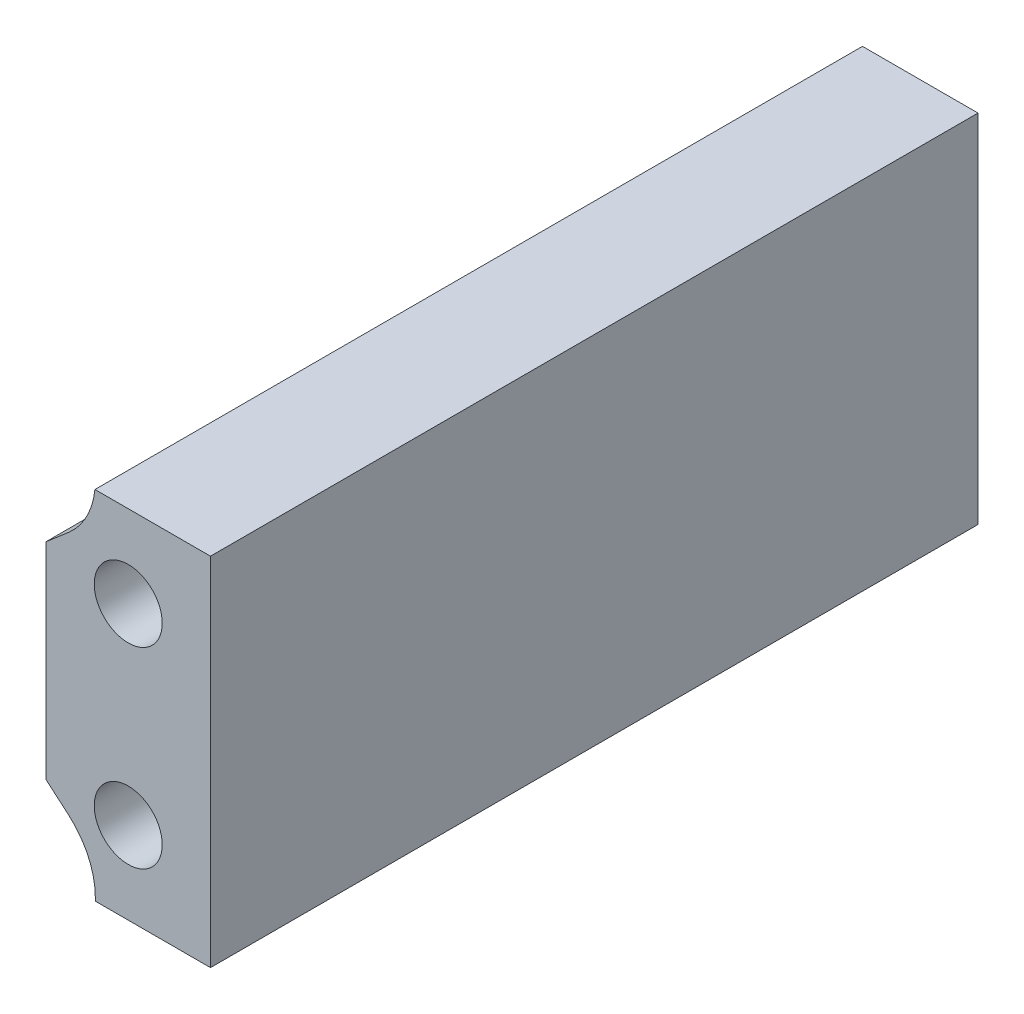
ISO-10303-21;
HEADER;
FILE_DESCRIPTION(('STEP AP214'),'2;1');
FILE_NAME('part.step','',(''),(''),'','','');
FILE_SCHEMA(('AUTOMOTIVE_DESIGN { 1 0 10303 214 1 1 1 1 }'));
ENDSEC;
DATA;
#1=APPLICATION_CONTEXT('core data for automotive mechanical design processes');
#2=APPLICATION_PROTOCOL_DEFINITION('international standard','automotive_design',2000,#1);
#3=PRODUCT_CONTEXT('',#1,'mechanical');
#4=PRODUCT('Part','Part','',(#3));
#5=PRODUCT_RELATED_PRODUCT_CATEGORY('part','',(#4));
#6=PRODUCT_DEFINITION_FORMATION('','',#4);
#7=PRODUCT_DEFINITION_CONTEXT('part definition',#1,'design');
#8=PRODUCT_DEFINITION('design','',#6,#7);
#9=PRODUCT_DEFINITION_SHAPE('','',#8);
#10=(LENGTH_UNIT() NAMED_UNIT(*) SI_UNIT(.MILLI.,.METRE.));
#11=(NAMED_UNIT(*) PLANE_ANGLE_UNIT() SI_UNIT($,.RADIAN.));
#12=(NAMED_UNIT(*) SI_UNIT($,.STERADIAN.) SOLID_ANGLE_UNIT());
#13=UNCERTAINTY_MEASURE_WITH_UNIT(LENGTH_MEASURE(1.E-05),#10,'distance_accuracy_value','');
#14=(GEOMETRIC_REPRESENTATION_CONTEXT(3) GLOBAL_UNCERTAINTY_ASSIGNED_CONTEXT((#13)) GLOBAL_UNIT_ASSIGNED_CONTEXT((#10,
#11,#12)) REPRESENTATION_CONTEXT('',''));
#15=CARTESIAN_POINT('',(0.,0.,0.));
#16=DIRECTION('',(0.,0.,1.));
#17=DIRECTION('',(1.,0.,0.));
#18=AXIS2_PLACEMENT_3D('',#15,#16,#17);
#19=CARTESIAN_POINT('',(-5.44446038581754,20.4047482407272,70.));
#20=DIRECTION('',(0.650791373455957,-0.759256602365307,0.));
#21=DIRECTION('',(0.,0.,-1.));
#22=AXIS2_PLACEMENT_3D('',#19,#20,#21);
#23=PLANE('',#22);
#24=DIRECTION('',(-0.759256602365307,-0.650791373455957,0.));
#25=VECTOR('',#24,1.);
#26=CARTESIAN_POINT('',(-5.44446038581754,20.4047482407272,70.));
#27=LINE('',#26,#25);
#28=CARTESIAN_POINT('',(-5.44446038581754,20.4047482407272,70.));
#29=VERTEX_POINT('',#28);
#30=CARTESIAN_POINT('',(-7.5,18.6428571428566,70.));
#31=VERTEX_POINT('',#30);
#32=EDGE_CURVE('E160',#29,#31,#27,.T.);
#33=ORIENTED_EDGE('',*,*,#32,.F.);
#34=DIRECTION('',(0.,0.,-1.));
#35=VECTOR('',#34,1.);
#36=CARTESIAN_POINT('',(-5.44446038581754,20.4047482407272,70.));
#37=LINE('',#36,#35);
#38=CARTESIAN_POINT('',(-5.44446038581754,20.4047482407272,0.));
#39=VERTEX_POINT('',#38);
#40=EDGE_CURVE('E11',#29,#39,#37,.T.);
#41=ORIENTED_EDGE('',*,*,#40,.T.);
#42=DIRECTION('',(-0.759256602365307,-0.650791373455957,0.));
#43=VECTOR('',#42,1.);
#44=CARTESIAN_POINT('',(-5.44446038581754,20.4047482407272,0.));
#45=LINE('',#44,#43);
#46=CARTESIAN_POINT('',(-7.5,18.6428571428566,0.));
#47=VERTEX_POINT('',#46);
#48=EDGE_CURVE('E180',#39,#47,#45,.T.);
#49=ORIENTED_EDGE('',*,*,#48,.T.);
#50=DIRECTION('',(0.,0.,-1.));
#51=VECTOR('',#50,1.);
#52=CARTESIAN_POINT('',(-7.5,18.6428571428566,70.));
#53=LINE('',#52,#51);
#54=EDGE_CURVE('E203',#31,#47,#53,.T.);
#55=ORIENTED_EDGE('',*,*,#54,.F.);
#56=EDGE_LOOP('',(#33,#41,#49,#55));
#57=FACE_BOUND('',#56,.T.);
#58=ADVANCED_FACE('F17',(#57),#23,.F.);
#59=CARTESIAN_POINT('',(-10.0000000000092,25.7195444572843,70.));
#60=DIRECTION('',(0.,0.,-1.));
#61=DIRECTION('',(-1.,0.,0.));
#62=AXIS2_PLACEMENT_3D('',#59,#60,#61);
#63=CYLINDRICAL_SURFACE('',#62,7.);
#64=CARTESIAN_POINT('',(-10.0000000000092,25.7195444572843,0.));
#65=DIRECTION('',(0.,0.,-1.));
#66=DIRECTION('',(-1.,0.,0.));
#67=AXIS2_PLACEMENT_3D('',#64,#65,#66);
#68=CIRCLE('',#67,7.);
#69=CARTESIAN_POINT('',(-3.03707993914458,25.,0.));
#70=VERTEX_POINT('',#69);
#71=EDGE_CURVE('E184',#70,#39,#68,.T.);
#72=ORIENTED_EDGE('',*,*,#71,.T.);
#73=ORIENTED_EDGE('',*,*,#40,.F.);
#74=CARTESIAN_POINT('',(-10.0000000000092,25.7195444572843,70.));
#75=DIRECTION('',(0.,0.,-1.));
#76=DIRECTION('',(-1.,0.,0.));
#77=AXIS2_PLACEMENT_3D('',#74,#75,#76);
#78=CIRCLE('',#77,7.);
#79=CARTESIAN_POINT('',(-3.03707993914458,25.,70.));
#80=VERTEX_POINT('',#79);
#81=EDGE_CURVE('E166',#80,#29,#78,.T.);
#82=ORIENTED_EDGE('',*,*,#81,.F.);
#83=DIRECTION('',(0.,0.,1.));
#84=VECTOR('',#83,1.);
#85=CARTESIAN_POINT('',(-3.03707993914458,25.,70.));
#86=LINE('',#85,#84);
#87=EDGE_CURVE('E195',#70,#80,#86,.T.);
#88=ORIENTED_EDGE('',*,*,#87,.F.);
#89=EDGE_LOOP('',(#72,#73,#82,#88));
#90=FACE_BOUND('',#89,.T.);
#91=ADVANCED_FACE('F19',(#90),#63,.F.);
#92=CARTESIAN_POINT('',(-10.0000000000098,-7.21954445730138,70.));
#93=DIRECTION('',(0.,0.,-1.));
#94=DIRECTION('',(-1.,0.,0.));
#95=AXIS2_PLACEMENT_3D('',#92,#93,#94);
#96=CYLINDRICAL_SURFACE('',#95,7.);
#97=CARTESIAN_POINT('',(-10.0000000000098,-7.21954445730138,0.));
#98=DIRECTION('',(0.,0.,-1.));
#99=DIRECTION('',(-1.,0.,0.));
#100=AXIS2_PLACEMENT_3D('',#97,#98,#99);
#101=CIRCLE('',#100,7.);
#102=CARTESIAN_POINT('',(-5.4444603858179,-1.90474824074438,0.));
#103=VERTEX_POINT('',#102);
#104=CARTESIAN_POINT('',(-3.00000000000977,-7.2195444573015,0.));
#105=VERTEX_POINT('',#104);
#106=EDGE_CURVE('E171',#103,#105,#101,.T.);
#107=ORIENTED_EDGE('',*,*,#106,.T.);
#108=DIRECTION('',(0.,0.,-1.));
#109=VECTOR('',#108,1.);
#110=CARTESIAN_POINT('',(-3.00000000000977,-7.2195444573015,70.));
#111=LINE('',#110,#109);
#112=CARTESIAN_POINT('',(-3.00000000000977,-7.2195444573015,70.));
#113=VERTEX_POINT('',#112);
#114=EDGE_CURVE('E127',#113,#105,#111,.T.);
#115=ORIENTED_EDGE('',*,*,#114,.F.);
#116=CARTESIAN_POINT('',(-10.0000000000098,-7.21954445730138,70.));
#117=DIRECTION('',(0.,0.,-1.));
#118=DIRECTION('',(-1.,0.,0.));
#119=AXIS2_PLACEMENT_3D('',#116,#117,#118);
#120=CIRCLE('',#119,7.);
#121=CARTESIAN_POINT('',(-5.4444603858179,-1.90474824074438,70.));
#122=VERTEX_POINT('',#121);
#123=EDGE_CURVE('E132',#122,#113,#120,.T.);
#124=ORIENTED_EDGE('',*,*,#123,.F.);
#125=DIRECTION('',(0.,0.,-1.));
#126=VECTOR('',#125,1.);
#127=CARTESIAN_POINT('',(-5.4444603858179,-1.90474824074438,70.));
#128=LINE('',#127,#126);
#129=EDGE_CURVE('E26',#122,#103,#128,.T.);
#130=ORIENTED_EDGE('',*,*,#129,.T.);
#131=EDGE_LOOP('',(#107,#115,#124,#130));
#132=FACE_BOUND('',#131,.T.);
#133=ADVANCED_FACE('F139',(#132),#96,.F.);
#134=CARTESIAN_POINT('',(-7.55553961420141,-0.0952517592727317,70.));
#135=DIRECTION('',(0.650791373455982,0.759256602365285,0.));
#136=DIRECTION('',(0.,0.,-1.));
#137=AXIS2_PLACEMENT_3D('',#134,#135,#136);
#138=PLANE('',#137);
#139=DIRECTION('',(0.759256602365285,-0.650791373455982,0.));
#140=VECTOR('',#139,1.);
#141=CARTESIAN_POINT('',(-7.55553961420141,-0.0952517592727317,0.));
#142=LINE('',#141,#140);
#143=CARTESIAN_POINT('',(-7.5,-0.142857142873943,0.));
#144=VERTEX_POINT('',#143);
#145=EDGE_CURVE('E121',#144,#103,#142,.T.);
#146=ORIENTED_EDGE('',*,*,#145,.T.);
#147=ORIENTED_EDGE('',*,*,#129,.F.);
#148=DIRECTION('',(0.759256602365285,-0.650791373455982,0.));
#149=VECTOR('',#148,1.);
#150=CARTESIAN_POINT('',(-7.55553961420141,-0.0952517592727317,70.));
#151=LINE('',#150,#149);
#152=CARTESIAN_POINT('',(-7.5,-0.142857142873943,70.));
#153=VERTEX_POINT('',#152);
#154=EDGE_CURVE('E118',#153,#122,#151,.T.);
#155=ORIENTED_EDGE('',*,*,#154,.F.);
#156=DIRECTION('',(0.,0.,1.));
#157=VECTOR('',#156,1.);
#158=CARTESIAN_POINT('',(-7.5,-0.142857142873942,70.));
#159=LINE('',#158,#157);
#160=EDGE_CURVE('E200',#144,#153,#159,.T.);
#161=ORIENTED_EDGE('',*,*,#160,.F.);
#162=EDGE_LOOP('',(#146,#147,#155,#161));
#163=FACE_BOUND('',#162,.T.);
#164=ADVANCED_FACE('F117',(#163),#138,.F.);
#165=CARTESIAN_POINT('',(-3.00000000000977,-7.2195444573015,70.));
#166=DIRECTION('',(1.,0.,0.));
#167=DIRECTION('',(0.,-1.,0.));
#168=AXIS2_PLACEMENT_3D('',#165,#166,#167);
#169=PLANE('',#168);
#170=DIRECTION('',(0.,-1.,0.));
#171=VECTOR('',#170,1.);
#172=CARTESIAN_POINT('',(-3.00000000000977,-7.2195444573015,70.));
#173=LINE('',#172,#171);
#174=CARTESIAN_POINT('',(-3.00000000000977,-7.5,70.));
#175=VERTEX_POINT('',#174);
#176=EDGE_CURVE('E142',#113,#175,#173,.T.);
#177=ORIENTED_EDGE('',*,*,#176,.F.);
#178=ORIENTED_EDGE('',*,*,#114,.T.);
#179=DIRECTION('',(0.,-1.,0.));
#180=VECTOR('',#179,1.);
#181=CARTESIAN_POINT('',(-3.00000000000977,-7.2195444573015,0.));
#182=LINE('',#181,#180);
#183=CARTESIAN_POINT('',(-3.00000000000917,-7.5,0.));
#184=VERTEX_POINT('',#183);
#185=EDGE_CURVE('E137',#105,#184,#182,.T.);
#186=ORIENTED_EDGE('',*,*,#185,.T.);
#187=DIRECTION('',(0.,0.,-1.));
#188=VECTOR('',#187,1.);
#189=CARTESIAN_POINT('',(-3.00000000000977,-7.5,70.));
#190=LINE('',#189,#188);
#191=EDGE_CURVE('E206',#175,#184,#190,.T.);
#192=ORIENTED_EDGE('',*,*,#191,.F.);
#193=EDGE_LOOP('',(#177,#178,#186,#192));
#194=FACE_BOUND('',#193,.T.);
#195=ADVANCED_FACE('F215',(#194),#169,.F.);
#196=CARTESIAN_POINT('',(7.5,-7.5,70.));
#197=DIRECTION('',(-1.,0.,0.));
#198=DIRECTION('',(0.,0.,1.));
#199=AXIS2_PLACEMENT_3D('',#196,#197,#198);
#200=PLANE('',#199);
#201=DIRECTION('',(0.,1.,0.));
#202=VECTOR('',#201,1.);
#203=CARTESIAN_POINT('',(7.5,-7.5,0.));
#204=LINE('',#203,#202);
#205=CARTESIAN_POINT('',(7.5,-7.5,0.));
#206=VERTEX_POINT('',#205);
#207=CARTESIAN_POINT('',(7.5,25.,0.));
#208=VERTEX_POINT('',#207);
#209=EDGE_CURVE('E189',#206,#208,#204,.T.);
#210=ORIENTED_EDGE('',*,*,#209,.T.);
#211=DIRECTION('',(0.,0.,-1.));
#212=VECTOR('',#211,1.);
#213=CARTESIAN_POINT('',(7.5,25.,70.));
#214=LINE('',#213,#212);
#215=CARTESIAN_POINT('',(7.5,25.,70.));
#216=VERTEX_POINT('',#215);
#217=EDGE_CURVE('E50',#216,#208,#214,.T.);
#218=ORIENTED_EDGE('',*,*,#217,.F.);
#219=DIRECTION('',(0.,1.,0.));
#220=VECTOR('',#219,1.);
#221=CARTESIAN_POINT('',(7.5,7.5,70.));
#222=LINE('',#221,#220);
#223=CARTESIAN_POINT('',(7.5,-7.5,70.));
#224=VERTEX_POINT('',#223);
#225=EDGE_CURVE('E158',#224,#216,#222,.T.);
#226=ORIENTED_EDGE('',*,*,#225,.F.);
#227=DIRECTION('',(0.,0.,-1.));
#228=VECTOR('',#227,1.);
#229=CARTESIAN_POINT('',(7.5,-7.5,70.));
#230=LINE('',#229,#228);
#231=EDGE_CURVE('E39',#224,#206,#230,.T.);
#232=ORIENTED_EDGE('',*,*,#231,.T.);
#233=EDGE_LOOP('',(#210,#218,#226,#232));
#234=FACE_BOUND('',#233,.T.);
#235=ADVANCED_FACE('F283',(#234),#200,.F.);
#236=CARTESIAN_POINT('',(-7.5,-7.5,70.));
#237=DIRECTION('',(0.,1.,0.));
#238=DIRECTION('',(1.,0.,0.));
#239=AXIS2_PLACEMENT_3D('',#236,#237,#238);
#240=PLANE('',#239);
#241=DIRECTION('',(1.,0.,0.));
#242=VECTOR('',#241,1.);
#243=CARTESIAN_POINT('',(-7.5,-7.5,70.));
#244=LINE('',#243,#242);
#245=EDGE_CURVE('E150',#175,#224,#244,.T.);
#246=ORIENTED_EDGE('',*,*,#245,.F.);
#247=ORIENTED_EDGE('',*,*,#191,.T.);
#248=DIRECTION('',(1.,0.,0.));
#249=VECTOR('',#248,1.);
#250=CARTESIAN_POINT('',(-7.5,-7.5,0.));
#251=LINE('',#250,#249);
#252=EDGE_CURVE('E192',#184,#206,#251,.T.);
#253=ORIENTED_EDGE('',*,*,#252,.T.);
#254=ORIENTED_EDGE('',*,*,#231,.F.);
#255=EDGE_LOOP('',(#246,#247,#253,#254));
#256=FACE_BOUND('',#255,.T.);
#257=ADVANCED_FACE('F224',(#256),#240,.F.);
#258=CARTESIAN_POINT('',(-7.5,-7.5,70.));
#259=DIRECTION('',(1.,0.,0.));
#260=DIRECTION('',(0.,1.,0.));
#261=AXIS2_PLACEMENT_3D('',#258,#259,#260);
#262=PLANE('',#261);
#263=DIRECTION('',(0.,-1.,0.));
#264=VECTOR('',#263,1.);
#265=CARTESIAN_POINT('',(-7.5,-7.5,0.));
#266=LINE('',#265,#264);
#267=EDGE_CURVE('E176',#47,#144,#266,.T.);
#268=ORIENTED_EDGE('',*,*,#267,.T.);
#269=ORIENTED_EDGE('',*,*,#160,.T.);
#270=DIRECTION('',(0.,-1.,0.));
#271=VECTOR('',#270,1.);
#272=CARTESIAN_POINT('',(-7.5,7.5,70.));
#273=LINE('',#272,#271);
#274=EDGE_CURVE('E135',#31,#153,#273,.T.);
#275=ORIENTED_EDGE('',*,*,#274,.F.);
#276=ORIENTED_EDGE('',*,*,#54,.T.);
#277=EDGE_LOOP('',(#268,#269,#275,#276));
#278=FACE_BOUND('',#277,.T.);
#279=ADVANCED_FACE('F274',(#278),#262,.F.);
#280=CARTESIAN_POINT('',(-7.5,25.,70.));
#281=DIRECTION('',(0.,-1.,0.));
#282=DIRECTION('',(0.,0.,-1.));
#283=AXIS2_PLACEMENT_3D('',#280,#281,#282);
#284=PLANE('',#283);
#285=DIRECTION('',(-1.,0.,0.));
#286=VECTOR('',#285,1.);
#287=CARTESIAN_POINT('',(-7.5,25.,0.));
#288=LINE('',#287,#286);
#289=EDGE_CURVE('E188',#208,#70,#288,.T.);
#290=ORIENTED_EDGE('',*,*,#289,.T.);
#291=ORIENTED_EDGE('',*,*,#87,.T.);
#292=DIRECTION('',(-1.,0.,0.));
#293=VECTOR('',#292,1.);
#294=CARTESIAN_POINT('',(-7.5,25.,70.));
#295=LINE('',#294,#293);
#296=EDGE_CURVE('E228',#216,#80,#295,.T.);
#297=ORIENTED_EDGE('',*,*,#296,.F.);
#298=ORIENTED_EDGE('',*,*,#217,.T.);
#299=EDGE_LOOP('',(#290,#291,#297,#298));
#300=FACE_BOUND('',#299,.T.);
#301=ADVANCED_FACE('F266',(#300),#284,.F.);
#302=CARTESIAN_POINT('',(0.,0.,0.));
#303=DIRECTION('',(0.,0.,-1.));
#304=DIRECTION('',(0.,-1.,0.));
#305=AXIS2_PLACEMENT_3D('',#302,#303,#304);
#306=PLANE('',#305);
#307=CARTESIAN_POINT('',(0.,17.5,0.));
#308=DIRECTION('',(0.,0.,1.));
#309=DIRECTION('',(1.,0.,0.));
#310=AXIS2_PLACEMENT_3D('',#307,#308,#309);
#311=CIRCLE('',#310,3.1);
#312=CARTESIAN_POINT('',(3.1,17.5,0.));
#313=VERTEX_POINT('',#312);
#314=EDGE_CURVE('E240',#313,#313,#311,.T.);
#315=ORIENTED_EDGE('',*,*,#314,.T.);
#316=EDGE_LOOP('',(#315));
#317=FACE_BOUND('',#316,.T.);
#318=CARTESIAN_POINT('',(0.,0.,0.));
#319=DIRECTION('',(0.,0.,1.));
#320=DIRECTION('',(1.,0.,0.));
#321=AXIS2_PLACEMENT_3D('',#318,#319,#320);
#322=CIRCLE('',#321,3.1);
#323=CARTESIAN_POINT('',(3.1,0.,0.));
#324=VERTEX_POINT('',#323);
#325=EDGE_CURVE('E143',#324,#324,#322,.T.);
#326=ORIENTED_EDGE('',*,*,#325,.T.);
#327=EDGE_LOOP('',(#326));
#328=FACE_BOUND('',#327,.T.);
#329=ORIENTED_EDGE('',*,*,#185,.F.);
#330=ORIENTED_EDGE('',*,*,#106,.F.);
#331=ORIENTED_EDGE('',*,*,#145,.F.);
#332=ORIENTED_EDGE('',*,*,#267,.F.);
#333=ORIENTED_EDGE('',*,*,#48,.F.);
#334=ORIENTED_EDGE('',*,*,#71,.F.);
#335=ORIENTED_EDGE('',*,*,#289,.F.);
#336=ORIENTED_EDGE('',*,*,#209,.F.);
#337=ORIENTED_EDGE('',*,*,#252,.F.);
#338=EDGE_LOOP('',(#329,#330,#331,#332,#333,#334,#335,#336,#337));
#339=FACE_BOUND('',#338,.T.);
#340=ADVANCED_FACE('F219',(#317,#328,#339),#306,.T.);
#341=CARTESIAN_POINT('',(0.,0.,70.));
#342=DIRECTION('',(0.,0.,-1.));
#343=DIRECTION('',(0.,-1.,0.));
#344=AXIS2_PLACEMENT_3D('',#341,#342,#343);
#345=PLANE('',#344);
#346=CARTESIAN_POINT('',(0.,17.5,70.));
#347=DIRECTION('',(0.,0.,1.));
#348=DIRECTION('',(1.,0.,0.));
#349=AXIS2_PLACEMENT_3D('',#346,#347,#348);
#350=CIRCLE('',#349,3.1);
#351=CARTESIAN_POINT('',(3.1,17.5,70.));
#352=VERTEX_POINT('',#351);
#353=EDGE_CURVE('E249',#352,#352,#350,.T.);
#354=ORIENTED_EDGE('',*,*,#353,.F.);
#355=EDGE_LOOP('',(#354));
#356=FACE_BOUND('',#355,.T.);
#357=CARTESIAN_POINT('',(0.,0.,70.));
#358=DIRECTION('',(0.,0.,1.));
#359=DIRECTION('',(1.,0.,0.));
#360=AXIS2_PLACEMENT_3D('',#357,#358,#359);
#361=CIRCLE('',#360,3.1);
#362=CARTESIAN_POINT('',(3.1,0.,70.));
#363=VERTEX_POINT('',#362);
#364=EDGE_CURVE('E154',#363,#363,#361,.T.);
#365=ORIENTED_EDGE('',*,*,#364,.F.);
#366=EDGE_LOOP('',(#365));
#367=FACE_BOUND('',#366,.T.);
#368=ORIENTED_EDGE('',*,*,#123,.T.);
#369=ORIENTED_EDGE('',*,*,#176,.T.);
#370=ORIENTED_EDGE('',*,*,#245,.T.);
#371=ORIENTED_EDGE('',*,*,#225,.T.);
#372=ORIENTED_EDGE('',*,*,#296,.T.);
#373=ORIENTED_EDGE('',*,*,#81,.T.);
#374=ORIENTED_EDGE('',*,*,#32,.T.);
#375=ORIENTED_EDGE('',*,*,#274,.T.);
#376=ORIENTED_EDGE('',*,*,#154,.T.);
#377=EDGE_LOOP('',(#368,#369,#370,#371,#372,#373,#374,#375,#376));
#378=FACE_BOUND('',#377,.T.);
#379=ADVANCED_FACE('F130',(#356,#367,#378),#345,.F.);
#380=CARTESIAN_POINT('',(0.,0.,70.));
#381=DIRECTION('',(0.,0.,-1.));
#382=DIRECTION('',(-1.,0.,0.));
#383=AXIS2_PLACEMENT_3D('',#380,#381,#382);
#384=CYLINDRICAL_SURFACE('',#383,3.1);
#385=ORIENTED_EDGE('',*,*,#325,.F.);
#386=EDGE_LOOP('',(#385));
#387=FACE_BOUND('',#386,.T.);
#388=ORIENTED_EDGE('',*,*,#364,.T.);
#389=EDGE_LOOP('',(#388));
#390=FACE_BOUND('',#389,.T.);
#391=ADVANCED_FACE('F293',(#387,#390),#384,.F.);
#392=CARTESIAN_POINT('',(0.,17.5,70.));
#393=DIRECTION('',(0.,0.,-1.));
#394=DIRECTION('',(-1.,0.,0.));
#395=AXIS2_PLACEMENT_3D('',#392,#393,#394);
#396=CYLINDRICAL_SURFACE('',#395,3.1);
#397=ORIENTED_EDGE('',*,*,#314,.F.);
#398=EDGE_LOOP('',(#397));
#399=FACE_BOUND('',#398,.T.);
#400=ORIENTED_EDGE('',*,*,#353,.T.);
#401=EDGE_LOOP('',(#400));
#402=FACE_BOUND('',#401,.T.);
#403=ADVANCED_FACE('F297',(#399,#402),#396,.F.);
#404=CLOSED_SHELL('',(#58,#91,#133,#164,#195,#235,#257,#279,#301,#340,#379,#391,#403));
#405=MANIFOLD_SOLID_BREP('B1',#404);
#406=ADVANCED_BREP_SHAPE_REPRESENTATION('',(#18,#405),#14);
#407=SHAPE_DEFINITION_REPRESENTATION(#9,#406);
ENDSEC;
END-ISO-10303-21;
